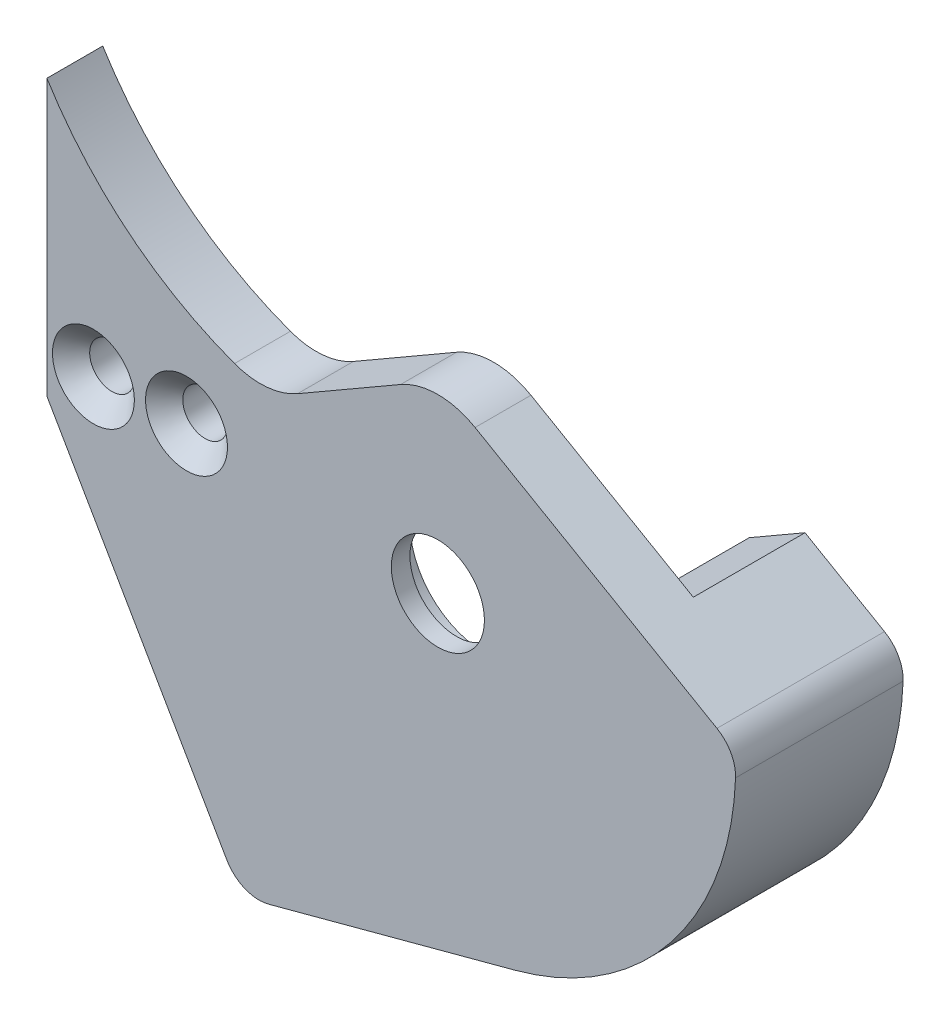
ISO-10303-21;
HEADER;
FILE_DESCRIPTION(('STEP AP214'),'2;1');
FILE_NAME('part.step','',(''),(''),'','','');
FILE_SCHEMA(('AUTOMOTIVE_DESIGN { 1 0 10303 214 1 1 1 1 }'));
ENDSEC;
DATA;
#1=APPLICATION_CONTEXT('core data for automotive mechanical design processes');
#2=APPLICATION_PROTOCOL_DEFINITION('international standard','automotive_design',2000,#1);
#3=PRODUCT_CONTEXT('',#1,'mechanical');
#4=PRODUCT('Part','Part','',(#3));
#5=PRODUCT_RELATED_PRODUCT_CATEGORY('part','',(#4));
#6=PRODUCT_DEFINITION_FORMATION('','',#4);
#7=PRODUCT_DEFINITION_CONTEXT('part definition',#1,'design');
#8=PRODUCT_DEFINITION('design','',#6,#7);
#9=PRODUCT_DEFINITION_SHAPE('','',#8);
#10=(LENGTH_UNIT() NAMED_UNIT(*) SI_UNIT(.MILLI.,.METRE.));
#11=(NAMED_UNIT(*) PLANE_ANGLE_UNIT() SI_UNIT($,.RADIAN.));
#12=(NAMED_UNIT(*) SI_UNIT($,.STERADIAN.) SOLID_ANGLE_UNIT());
#13=UNCERTAINTY_MEASURE_WITH_UNIT(LENGTH_MEASURE(1.E-05),#10,'distance_accuracy_value','');
#14=(GEOMETRIC_REPRESENTATION_CONTEXT(3) GLOBAL_UNCERTAINTY_ASSIGNED_CONTEXT((#13)) GLOBAL_UNIT_ASSIGNED_CONTEXT((#10,
#11,#12)) REPRESENTATION_CONTEXT('',''));
#15=CARTESIAN_POINT('',(0.,0.,0.));
#16=DIRECTION('',(0.,0.,1.));
#17=DIRECTION('',(1.,0.,0.));
#18=AXIS2_PLACEMENT_3D('',#15,#16,#17);
#19=CARTESIAN_POINT('',(39.,43.5,8.));
#20=DIRECTION('',(0.,0.,-1.));
#21=DIRECTION('',(-1.,0.,0.));
#22=AXIS2_PLACEMENT_3D('',#19,#20,#21);
#23=CYLINDRICAL_SURFACE('',#22,4.);
#24=CARTESIAN_POINT('',(39.,43.5,8.));
#25=DIRECTION('',(0.,0.,-1.));
#26=DIRECTION('',(-1.,0.,0.));
#27=AXIS2_PLACEMENT_3D('',#24,#25,#26);
#28=CIRCLE('',#27,4.);
#29=CARTESIAN_POINT('',(35.,43.5,8.));
#30=VERTEX_POINT('',#29);
#31=EDGE_CURVE('E305',#30,#30,#28,.T.);
#32=ORIENTED_EDGE('',*,*,#31,.F.);
#33=EDGE_LOOP('',(#32));
#34=FACE_BOUND('',#33,.T.);
#35=CARTESIAN_POINT('',(39.,43.5,6.5));
#36=DIRECTION('',(0.,0.,-1.));
#37=DIRECTION('',(-1.,0.,0.));
#38=AXIS2_PLACEMENT_3D('',#35,#36,#37);
#39=CIRCLE('',#38,4.);
#40=CARTESIAN_POINT('',(35.,43.5,6.5));
#41=VERTEX_POINT('',#40);
#42=EDGE_CURVE('E37',#41,#41,#39,.F.);
#43=ORIENTED_EDGE('',*,*,#42,.F.);
#44=EDGE_LOOP('',(#43));
#45=FACE_BOUND('',#44,.T.);
#46=ADVANCED_FACE('F33',(#34,#45),#23,.F.);
#47=CARTESIAN_POINT('',(39.,43.5,9.));
#48=DIRECTION('',(0.,0.,-1.));
#49=DIRECTION('',(-1.,0.,0.));
#50=AXIS2_PLACEMENT_3D('',#47,#48,#49);
#51=CYLINDRICAL_SURFACE('',#50,2.5);
#52=CARTESIAN_POINT('',(39.,43.5,9.));
#53=DIRECTION('',(0.,0.,1.));
#54=DIRECTION('',(1.,0.,0.));
#55=AXIS2_PLACEMENT_3D('',#52,#53,#54);
#56=CIRCLE('',#55,2.5);
#57=CARTESIAN_POINT('',(41.5,43.5,9.));
#58=VERTEX_POINT('',#57);
#59=EDGE_CURVE('E330',#58,#58,#56,.T.);
#60=ORIENTED_EDGE('',*,*,#59,.T.);
#61=EDGE_LOOP('',(#60));
#62=FACE_BOUND('',#61,.T.);
#63=CARTESIAN_POINT('',(39.,43.5,8.));
#64=DIRECTION('',(0.,0.,-1.));
#65=DIRECTION('',(-1.,0.,0.));
#66=AXIS2_PLACEMENT_3D('',#63,#64,#65);
#67=CIRCLE('',#66,2.5);
#68=CARTESIAN_POINT('',(36.5,43.5,8.));
#69=VERTEX_POINT('',#68);
#70=EDGE_CURVE('E202',#69,#69,#67,.T.);
#71=ORIENTED_EDGE('',*,*,#70,.T.);
#72=EDGE_LOOP('',(#71));
#73=FACE_BOUND('',#72,.T.);
#74=ADVANCED_FACE('F462',(#62,#73),#51,.F.);
#75=CARTESIAN_POINT('',(30.8459427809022,29.9270889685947,0.));
#76=DIRECTION('',(0.,0.,-1.));
#77=DIRECTION('',(-1.,0.,0.));
#78=AXIS2_PLACEMENT_3D('',#75,#76,#77);
#79=PLANE('',#78);
#80=DIRECTION('',(-0.866025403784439,-0.5,0.));
#81=VECTOR('',#80,1.);
#82=CARTESIAN_POINT('',(26.2161102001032,33.9461942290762,0.));
#83=LINE('',#82,#81);
#84=CARTESIAN_POINT('',(26.2161102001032,33.9461942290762,0.));
#85=VERTEX_POINT('',#84);
#86=CARTESIAN_POINT('',(23.6180339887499,32.4461942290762,0.));
#87=VERTEX_POINT('',#86);
#88=EDGE_CURVE('E181',#85,#87,#83,.T.);
#89=ORIENTED_EDGE('',*,*,#88,.F.);
#90=DIRECTION('',(-0.5,0.866025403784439,0.));
#91=VECTOR('',#90,1.);
#92=CARTESIAN_POINT('',(21.3425161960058,42.3875066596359,0.));
#93=LINE('',#92,#91);
#94=CARTESIAN_POINT('',(29.1138919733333,28.9270889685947,0.));
#95=VERTEX_POINT('',#94);
#96=EDGE_CURVE('E237',#95,#85,#93,.T.);
#97=ORIENTED_EDGE('',*,*,#96,.F.);
#98=CARTESIAN_POINT('',(30.8459427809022,29.9270889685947,0.));
#99=DIRECTION('',(0.,0.,-1.));
#100=DIRECTION('',(-1.,0.,0.));
#101=AXIS2_PLACEMENT_3D('',#98,#99,#100);
#102=CIRCLE('',#101,2.);
#103=CARTESIAN_POINT('',(31.3635808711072,27.9952373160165,0.));
#104=VERTEX_POINT('',#103);
#105=EDGE_CURVE('E234',#104,#95,#102,.T.);
#106=ORIENTED_EDGE('',*,*,#105,.F.);
#107=DIRECTION('',(-0.965925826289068,-0.258819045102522,0.));
#108=VECTOR('',#107,1.);
#109=CARTESIAN_POINT('',(31.3635808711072,27.9952373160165,0.));
#110=LINE('',#109,#108);
#111=CARTESIAN_POINT('',(42.3646475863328,30.9429642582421,0.));
#112=VERTEX_POINT('',#111);
#113=EDGE_CURVE('E232',#112,#104,#110,.T.);
#114=ORIENTED_EDGE('',*,*,#113,.F.);
#115=CARTESIAN_POINT('',(39.,43.5,0.));
#116=DIRECTION('',(0.,0.,-1.));
#117=DIRECTION('',(1.,0.,0.));
#118=AXIS2_PLACEMENT_3D('',#115,#116,#117);
#119=CIRCLE('',#118,13.);
#120=CARTESIAN_POINT('',(51.7540554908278,40.9832424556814,0.));
#121=VERTEX_POINT('',#120);
#122=EDGE_CURVE('E230',#121,#112,#119,.T.);
#123=ORIENTED_EDGE('',*,*,#122,.F.);
#124=CARTESIAN_POINT('',(49.7918931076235,41.3704359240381,0.));
#125=DIRECTION('',(0.,0.,-1.));
#126=DIRECTION('',(-1.,0.,0.));
#127=AXIS2_PLACEMENT_3D('',#124,#125,#126);
#128=CIRCLE('',#127,2.);
#129=CARTESIAN_POINT('',(50.7918931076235,43.102486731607,0.));
#130=VERTEX_POINT('',#129);
#131=EDGE_CURVE('E228',#130,#121,#128,.T.);
#132=ORIENTED_EDGE('',*,*,#131,.F.);
#133=DIRECTION('',(0.866025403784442,-0.499999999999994,0.));
#134=VECTOR('',#133,1.);
#135=CARTESIAN_POINT('',(46.7204784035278,45.4531191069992,0.));
#136=LINE('',#135,#134);
#137=CARTESIAN_POINT('',(46.7204784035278,45.4531191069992,0.));
#138=VERTEX_POINT('',#137);
#139=EDGE_CURVE('E226',#138,#130,#136,.T.);
#140=ORIENTED_EDGE('',*,*,#139,.F.);
#141=DIRECTION('',(-0.866025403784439,-0.5,0.));
#142=VECTOR('',#141,1.);
#143=CARTESIAN_POINT('',(46.7204784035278,45.4531191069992,0.));
#144=LINE('',#143,#142);
#145=CARTESIAN_POINT('',(49.7204784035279,47.1851699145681,0.));
#146=VERTEX_POINT('',#145);
#147=EDGE_CURVE('E224',#146,#138,#144,.T.);
#148=ORIENTED_EDGE('',*,*,#147,.F.);
#149=DIRECTION('',(-0.866025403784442,0.499999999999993,0.));
#150=VECTOR('',#149,1.);
#151=CARTESIAN_POINT('',(49.7204784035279,47.1851699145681,0.));
#152=LINE('',#151,#150);
#153=CARTESIAN_POINT('',(53.9906253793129,44.7197994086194,0.));
#154=VERTEX_POINT('',#153);
#155=EDGE_CURVE('E222',#154,#146,#152,.T.);
#156=ORIENTED_EDGE('',*,*,#155,.F.);
#157=CARTESIAN_POINT('',(52.9906253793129,42.9877486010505,0.));
#158=DIRECTION('',(0.,0.,1.));
#159=DIRECTION('',(-1.,0.,0.));
#160=AXIS2_PLACEMENT_3D('',#157,#158,#159);
#161=CIRCLE('',#160,2.);
#162=CARTESIAN_POINT('',(54.9892861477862,42.914569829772,0.));
#163=VERTEX_POINT('',#162);
#164=EDGE_CURVE('E220',#163,#154,#161,.T.);
#165=ORIENTED_EDGE('',*,*,#164,.F.);
#166=CARTESIAN_POINT('',(39.,43.5,0.));
#167=DIRECTION('',(0.,0.,1.));
#168=DIRECTION('',(1.,0.,0.));
#169=AXIS2_PLACEMENT_3D('',#166,#167,#168);
#170=CIRCLE('',#169,16.);
#171=CARTESIAN_POINT('',(43.1411047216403,28.0451867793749,0.));
#172=VERTEX_POINT('',#171);
#173=EDGE_CURVE('E218',#172,#163,#170,.T.);
#174=ORIENTED_EDGE('',*,*,#173,.F.);
#175=DIRECTION('',(0.965925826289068,0.258819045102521,0.));
#176=VECTOR('',#175,1.);
#177=CARTESIAN_POINT('',(29.9164951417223,24.501663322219,0.));
#178=LINE('',#177,#176);
#179=CARTESIAN_POINT('',(29.9164951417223,24.501663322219,0.));
#180=VERTEX_POINT('',#179);
#181=EDGE_CURVE('E216',#180,#172,#178,.T.);
#182=ORIENTED_EDGE('',*,*,#181,.F.);
#183=CARTESIAN_POINT('',(29.3988570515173,26.4335149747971,0.));
#184=DIRECTION('',(0.,0.,1.));
#185=DIRECTION('',(-1.,0.,0.));
#186=AXIS2_PLACEMENT_3D('',#183,#184,#185);
#187=CIRCLE('',#186,2.);
#188=CARTESIAN_POINT('',(27.6668062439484,25.4335149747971,0.));
#189=VERTEX_POINT('',#188);
#190=EDGE_CURVE('E207',#189,#180,#187,.T.);
#191=ORIENTED_EDGE('',*,*,#190,.F.);
#192=DIRECTION('',(0.5,-0.866025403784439,0.));
#193=VECTOR('',#192,1.);
#194=CARTESIAN_POINT('',(18.,42.1769145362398,0.));
#195=LINE('',#194,#193);
#196=EDGE_CURVE('E198',#87,#189,#195,.T.);
#197=ORIENTED_EDGE('',*,*,#196,.F.);
#198=EDGE_LOOP('',(#89,#97,#106,#114,#123,#132,#140,#148,#156,#165,#174,#182,#191,#197));
#199=FACE_BOUND('',#198,.T.);
#200=ADVANCED_FACE('F205',(#199),#79,.T.);
#201=CARTESIAN_POINT('',(18.,42.1769145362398,6.));
#202=DIRECTION('',(0.062879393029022,-0.998021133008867,0.));
#203=DIRECTION('',(0.998021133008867,0.062879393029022,0.));
#204=AXIS2_PLACEMENT_3D('',#201,#202,#203);
#205=PLANE('',#204);
#206=DIRECTION('',(-0.998021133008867,-0.062879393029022,0.));
#207=VECTOR('',#206,1.);
#208=CARTESIAN_POINT('',(18.,42.1769145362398,0.));
#209=LINE('',#208,#207);
#210=CARTESIAN_POINT('',(21.3425161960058,42.3875066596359,0.));
#211=VERTEX_POINT('',#210);
#212=CARTESIAN_POINT('',(18.,42.1769145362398,0.));
#213=VERTEX_POINT('',#212);
#214=EDGE_CURVE('E208',#211,#213,#209,.T.);
#215=ORIENTED_EDGE('',*,*,#214,.T.);
#216=DIRECTION('',(0.,0.,-1.));
#217=VECTOR('',#216,1.);
#218=CARTESIAN_POINT('',(18.,42.1769145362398,6.));
#219=LINE('',#218,#217);
#220=CARTESIAN_POINT('',(18.,42.1769145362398,6.));
#221=VERTEX_POINT('',#220);
#222=EDGE_CURVE('E277',#221,#213,#219,.T.);
#223=ORIENTED_EDGE('',*,*,#222,.F.);
#224=DIRECTION('',(-0.998021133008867,-0.062879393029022,0.));
#225=VECTOR('',#224,1.);
#226=CARTESIAN_POINT('',(18.,42.1769145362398,6.));
#227=LINE('',#226,#225);
#228=CARTESIAN_POINT('',(21.3425161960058,42.3875066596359,6.));
#229=VERTEX_POINT('',#228);
#230=EDGE_CURVE('E239',#229,#221,#227,.T.);
#231=ORIENTED_EDGE('',*,*,#230,.F.);
#232=DIRECTION('',(0.,0.,-1.));
#233=VECTOR('',#232,1.);
#234=CARTESIAN_POINT('',(21.3425161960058,42.3875066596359,6.));
#235=LINE('',#234,#233);
#236=EDGE_CURVE('E240',#229,#211,#235,.T.);
#237=ORIENTED_EDGE('',*,*,#236,.T.);
#238=EDGE_LOOP('',(#215,#223,#231,#237));
#239=FACE_BOUND('',#238,.T.);
#240=ADVANCED_FACE('F401',(#239),#205,.F.);
#241=CARTESIAN_POINT('',(18.,42.1769145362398,6.));
#242=DIRECTION('',(0.866025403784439,0.5,0.));
#243=DIRECTION('',(-0.5,0.866025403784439,0.));
#244=AXIS2_PLACEMENT_3D('',#241,#242,#243);
#245=PLANE('',#244);
#246=CARTESIAN_POINT('',(21.3819660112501,36.3191775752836,0.));
#247=VERTEX_POINT('',#246);
#248=EDGE_CURVE('E201',#213,#247,#195,.T.);
#249=ORIENTED_EDGE('',*,*,#248,.T.);
#250=CARTESIAN_POINT('',(22.5,34.3826859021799,2.));
#251=DIRECTION('',(-0.866025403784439,-0.5,0.));
#252=DIRECTION('',(0.5,-0.866025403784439,0.));
#253=AXIS2_PLACEMENT_3D('',#250,#251,#252);
#254=CIRCLE('',#253,3.);
#255=EDGE_CURVE('E184',#87,#247,#254,.T.);
#256=ORIENTED_EDGE('',*,*,#255,.F.);
#257=ORIENTED_EDGE('',*,*,#196,.T.);
#258=DIRECTION('',(0.,0.,-1.));
#259=VECTOR('',#258,1.);
#260=CARTESIAN_POINT('',(27.6668062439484,25.4335149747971,6.));
#261=LINE('',#260,#259);
#262=CARTESIAN_POINT('',(27.6668062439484,25.4335149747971,9.));
#263=VERTEX_POINT('',#262);
#264=EDGE_CURVE('E275',#263,#189,#261,.T.);
#265=ORIENTED_EDGE('',*,*,#264,.F.);
#266=DIRECTION('',(0.5,-0.866025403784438,0.));
#267=VECTOR('',#266,1.);
#268=CARTESIAN_POINT('',(18.,42.1769145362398,9.));
#269=LINE('',#268,#267);
#270=CARTESIAN_POINT('',(18.,42.1769145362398,9.));
#271=VERTEX_POINT('',#270);
#272=EDGE_CURVE('E338',#271,#263,#269,.T.);
#273=ORIENTED_EDGE('',*,*,#272,.F.);
#274=DIRECTION('',(0.,0.,-1.));
#275=VECTOR('',#274,1.);
#276=CARTESIAN_POINT('',(18.,42.1769145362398,9.));
#277=LINE('',#276,#275);
#278=EDGE_CURVE('E211',#271,#221,#277,.T.);
#279=ORIENTED_EDGE('',*,*,#278,.T.);
#280=ORIENTED_EDGE('',*,*,#222,.T.);
#281=EDGE_LOOP('',(#249,#256,#257,#265,#273,#279,#280));
#282=FACE_BOUND('',#281,.T.);
#283=ADVANCED_FACE('F197',(#282),#245,.F.);
#284=CARTESIAN_POINT('',(29.3988570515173,26.4335149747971,6.));
#285=DIRECTION('',(0.,0.,-1.));
#286=DIRECTION('',(-1.,0.,0.));
#287=AXIS2_PLACEMENT_3D('',#284,#285,#286);
#288=CYLINDRICAL_SURFACE('',#287,2.);
#289=ORIENTED_EDGE('',*,*,#190,.T.);
#290=DIRECTION('',(0.,0.,-1.));
#291=VECTOR('',#290,1.);
#292=CARTESIAN_POINT('',(29.9164951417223,24.501663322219,6.));
#293=LINE('',#292,#291);
#294=CARTESIAN_POINT('',(29.9164951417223,24.501663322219,9.));
#295=VERTEX_POINT('',#294);
#296=EDGE_CURVE('E272',#295,#180,#293,.T.);
#297=ORIENTED_EDGE('',*,*,#296,.F.);
#298=CARTESIAN_POINT('',(29.3988570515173,26.4335149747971,9.));
#299=DIRECTION('',(0.,0.,1.));
#300=DIRECTION('',(-1.,0.,0.));
#301=AXIS2_PLACEMENT_3D('',#298,#299,#300);
#302=CIRCLE('',#301,2.);
#303=EDGE_CURVE('E342',#263,#295,#302,.T.);
#304=ORIENTED_EDGE('',*,*,#303,.F.);
#305=ORIENTED_EDGE('',*,*,#264,.T.);
#306=EDGE_LOOP('',(#289,#297,#304,#305));
#307=FACE_BOUND('',#306,.T.);
#308=ADVANCED_FACE('F426',(#307),#288,.T.);
#309=CARTESIAN_POINT('',(29.9164951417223,24.501663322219,6.));
#310=DIRECTION('',(-0.258819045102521,0.965925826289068,0.));
#311=DIRECTION('',(-0.965925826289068,-0.258819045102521,0.));
#312=AXIS2_PLACEMENT_3D('',#309,#310,#311);
#313=PLANE('',#312);
#314=ORIENTED_EDGE('',*,*,#181,.T.);
#315=DIRECTION('',(0.,0.,-1.));
#316=VECTOR('',#315,1.);
#317=CARTESIAN_POINT('',(43.1411047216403,28.0451867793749,6.));
#318=LINE('',#317,#316);
#319=CARTESIAN_POINT('',(43.1411047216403,28.0451867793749,9.));
#320=VERTEX_POINT('',#319);
#321=EDGE_CURVE('E269',#320,#172,#318,.T.);
#322=ORIENTED_EDGE('',*,*,#321,.F.);
#323=DIRECTION('',(0.965925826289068,0.258819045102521,0.));
#324=VECTOR('',#323,1.);
#325=CARTESIAN_POINT('',(29.9164951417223,24.501663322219,9.));
#326=LINE('',#325,#324);
#327=EDGE_CURVE('E345',#295,#320,#326,.T.);
#328=ORIENTED_EDGE('',*,*,#327,.F.);
#329=ORIENTED_EDGE('',*,*,#296,.T.);
#330=EDGE_LOOP('',(#314,#322,#328,#329));
#331=FACE_BOUND('',#330,.T.);
#332=ADVANCED_FACE('F428',(#331),#313,.F.);
#333=CARTESIAN_POINT('',(39.,43.5,6.));
#334=DIRECTION('',(0.,0.,-1.));
#335=DIRECTION('',(-1.,0.,0.));
#336=AXIS2_PLACEMENT_3D('',#333,#334,#335);
#337=CYLINDRICAL_SURFACE('',#336,16.);
#338=ORIENTED_EDGE('',*,*,#173,.T.);
#339=DIRECTION('',(0.,0.,-1.));
#340=VECTOR('',#339,1.);
#341=CARTESIAN_POINT('',(54.9892861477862,42.914569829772,6.));
#342=LINE('',#341,#340);
#343=CARTESIAN_POINT('',(54.9892861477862,42.914569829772,9.));
#344=VERTEX_POINT('',#343);
#345=EDGE_CURVE('E266',#344,#163,#342,.T.);
#346=ORIENTED_EDGE('',*,*,#345,.F.);
#347=CARTESIAN_POINT('',(39.,43.5,9.));
#348=DIRECTION('',(0.,0.,1.));
#349=DIRECTION('',(1.,0.,0.));
#350=AXIS2_PLACEMENT_3D('',#347,#348,#349);
#351=CIRCLE('',#350,16.);
#352=EDGE_CURVE('E348',#320,#344,#351,.T.);
#353=ORIENTED_EDGE('',*,*,#352,.F.);
#354=ORIENTED_EDGE('',*,*,#321,.T.);
#355=EDGE_LOOP('',(#338,#346,#353,#354));
#356=FACE_BOUND('',#355,.T.);
#357=ADVANCED_FACE('F433',(#356),#337,.T.);
#358=CARTESIAN_POINT('',(52.9906253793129,42.9877486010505,6.));
#359=DIRECTION('',(0.,0.,-1.));
#360=DIRECTION('',(-1.,0.,0.));
#361=AXIS2_PLACEMENT_3D('',#358,#359,#360);
#362=CYLINDRICAL_SURFACE('',#361,2.);
#363=ORIENTED_EDGE('',*,*,#164,.T.);
#364=DIRECTION('',(0.,0.,-1.));
#365=VECTOR('',#364,1.);
#366=CARTESIAN_POINT('',(53.9906253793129,44.7197994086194,6.));
#367=LINE('',#366,#365);
#368=CARTESIAN_POINT('',(53.9906253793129,44.7197994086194,9.));
#369=VERTEX_POINT('',#368);
#370=EDGE_CURVE('E263',#369,#154,#367,.T.);
#371=ORIENTED_EDGE('',*,*,#370,.F.);
#372=CARTESIAN_POINT('',(52.9906253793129,42.9877486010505,9.));
#373=DIRECTION('',(0.,0.,1.));
#374=DIRECTION('',(-1.,0.,0.));
#375=AXIS2_PLACEMENT_3D('',#372,#373,#374);
#376=CIRCLE('',#375,2.);
#377=EDGE_CURVE('E351',#344,#369,#376,.T.);
#378=ORIENTED_EDGE('',*,*,#377,.F.);
#379=ORIENTED_EDGE('',*,*,#345,.T.);
#380=EDGE_LOOP('',(#363,#371,#378,#379));
#381=FACE_BOUND('',#380,.T.);
#382=ADVANCED_FACE('F437',(#381),#362,.T.);
#383=CARTESIAN_POINT('',(49.7204784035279,47.1851699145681,6.));
#384=DIRECTION('',(-0.499999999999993,-0.866025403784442,0.));
#385=DIRECTION('',(0.866025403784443,-0.499999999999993,0.));
#386=AXIS2_PLACEMENT_3D('',#383,#384,#385);
#387=PLANE('',#386);
#388=DIRECTION('',(-0.866025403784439,0.5,0.));
#389=VECTOR('',#388,1.);
#390=CARTESIAN_POINT('',(39.,53.3746410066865,6.));
#391=LINE('',#390,#389);
#392=CARTESIAN_POINT('',(49.7204784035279,47.1851699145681,6.));
#393=VERTEX_POINT('',#392);
#394=CARTESIAN_POINT('',(40.9999999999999,52.2199404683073,6.));
#395=VERTEX_POINT('',#394);
#396=EDGE_CURVE('E363',#393,#395,#391,.T.);
#397=ORIENTED_EDGE('',*,*,#396,.T.);
#398=DIRECTION('',(0.,0.,-1.));
#399=VECTOR('',#398,1.);
#400=CARTESIAN_POINT('',(40.9999999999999,52.2199404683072,6.));
#401=LINE('',#400,#399);
#402=CARTESIAN_POINT('',(40.9999999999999,52.2199404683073,9.));
#403=VERTEX_POINT('',#402);
#404=EDGE_CURVE('E56',#395,#403,#401,.F.);
#405=ORIENTED_EDGE('',*,*,#404,.T.);
#406=DIRECTION('',(-0.866025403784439,0.5,0.));
#407=VECTOR('',#406,1.);
#408=CARTESIAN_POINT('',(39.,53.3746410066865,9.));
#409=LINE('',#408,#407);
#410=EDGE_CURVE('E354',#369,#403,#409,.T.);
#411=ORIENTED_EDGE('',*,*,#410,.F.);
#412=ORIENTED_EDGE('',*,*,#370,.T.);
#413=ORIENTED_EDGE('',*,*,#155,.T.);
#414=DIRECTION('',(0.,0.,-1.));
#415=VECTOR('',#414,1.);
#416=CARTESIAN_POINT('',(49.7204784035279,47.1851699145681,6.));
#417=LINE('',#416,#415);
#418=EDGE_CURVE('E262',#393,#146,#417,.T.);
#419=ORIENTED_EDGE('',*,*,#418,.F.);
#420=EDGE_LOOP('',(#397,#405,#411,#412,#413,#419));
#421=FACE_BOUND('',#420,.T.);
#422=ADVANCED_FACE('F439',(#421),#387,.F.);
#423=CARTESIAN_POINT('',(46.7204784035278,45.4531191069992,6.));
#424=DIRECTION('',(0.5,-0.866025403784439,0.));
#425=DIRECTION('',(0.866025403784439,0.5,0.));
#426=AXIS2_PLACEMENT_3D('',#423,#424,#425);
#427=PLANE('',#426);
#428=ORIENTED_EDGE('',*,*,#147,.T.);
#429=DIRECTION('',(0.,0.,-1.));
#430=VECTOR('',#429,1.);
#431=CARTESIAN_POINT('',(46.7204784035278,45.4531191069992,6.));
#432=LINE('',#431,#430);
#433=CARTESIAN_POINT('',(46.7204784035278,45.4531191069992,6.));
#434=VERTEX_POINT('',#433);
#435=EDGE_CURVE('E259',#434,#138,#432,.T.);
#436=ORIENTED_EDGE('',*,*,#435,.F.);
#437=DIRECTION('',(-0.866025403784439,-0.5,0.));
#438=VECTOR('',#437,1.);
#439=CARTESIAN_POINT('',(46.7204784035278,45.4531191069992,6.));
#440=LINE('',#439,#438);
#441=EDGE_CURVE('E283',#393,#434,#440,.T.);
#442=ORIENTED_EDGE('',*,*,#441,.F.);
#443=ORIENTED_EDGE('',*,*,#418,.T.);
#444=EDGE_LOOP('',(#428,#436,#442,#443));
#445=FACE_BOUND('',#444,.T.);
#446=ADVANCED_FACE('F444',(#445),#427,.F.);
#447=CARTESIAN_POINT('',(46.7204784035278,45.4531191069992,6.));
#448=DIRECTION('',(0.499999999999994,0.866025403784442,0.));
#449=DIRECTION('',(-0.866025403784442,0.499999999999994,0.));
#450=AXIS2_PLACEMENT_3D('',#447,#448,#449);
#451=PLANE('',#450);
#452=ORIENTED_EDGE('',*,*,#139,.T.);
#453=DIRECTION('',(0.,0.,-1.));
#454=VECTOR('',#453,1.);
#455=CARTESIAN_POINT('',(50.7918931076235,43.102486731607,6.));
#456=LINE('',#455,#454);
#457=CARTESIAN_POINT('',(50.7918931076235,43.102486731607,6.));
#458=VERTEX_POINT('',#457);
#459=EDGE_CURVE('E256',#458,#130,#456,.T.);
#460=ORIENTED_EDGE('',*,*,#459,.F.);
#461=DIRECTION('',(0.866025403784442,-0.499999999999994,0.));
#462=VECTOR('',#461,1.);
#463=CARTESIAN_POINT('',(46.7204784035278,45.4531191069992,6.));
#464=LINE('',#463,#462);
#465=EDGE_CURVE('E286',#434,#458,#464,.T.);
#466=ORIENTED_EDGE('',*,*,#465,.F.);
#467=ORIENTED_EDGE('',*,*,#435,.T.);
#468=EDGE_LOOP('',(#452,#460,#466,#467));
#469=FACE_BOUND('',#468,.T.);
#470=ADVANCED_FACE('F448',(#469),#451,.F.);
#471=CARTESIAN_POINT('',(49.7918931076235,41.3704359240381,6.));
#472=DIRECTION('',(0.,0.,-1.));
#473=DIRECTION('',(-1.,0.,0.));
#474=AXIS2_PLACEMENT_3D('',#471,#472,#473);
#475=CYLINDRICAL_SURFACE('',#474,2.);
#476=ORIENTED_EDGE('',*,*,#131,.T.);
#477=DIRECTION('',(0.,0.,-1.));
#478=VECTOR('',#477,1.);
#479=CARTESIAN_POINT('',(51.7540554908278,40.9832424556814,6.));
#480=LINE('',#479,#478);
#481=CARTESIAN_POINT('',(51.7540554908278,40.9832424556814,6.));
#482=VERTEX_POINT('',#481);
#483=EDGE_CURVE('E253',#482,#121,#480,.T.);
#484=ORIENTED_EDGE('',*,*,#483,.F.);
#485=CARTESIAN_POINT('',(49.7918931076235,41.3704359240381,6.));
#486=DIRECTION('',(0.,0.,-1.));
#487=DIRECTION('',(-1.,0.,0.));
#488=AXIS2_PLACEMENT_3D('',#485,#486,#487);
#489=CIRCLE('',#488,2.);
#490=EDGE_CURVE('E376',#458,#482,#489,.T.);
#491=ORIENTED_EDGE('',*,*,#490,.F.);
#492=ORIENTED_EDGE('',*,*,#459,.T.);
#493=EDGE_LOOP('',(#476,#484,#491,#492));
#494=FACE_BOUND('',#493,.T.);
#495=ADVANCED_FACE('F502',(#494),#475,.F.);
#496=CARTESIAN_POINT('',(39.,43.5,6.));
#497=DIRECTION('',(0.,0.,-1.));
#498=DIRECTION('',(-1.,0.,0.));
#499=AXIS2_PLACEMENT_3D('',#496,#497,#498);
#500=CYLINDRICAL_SURFACE('',#499,13.);
#501=ORIENTED_EDGE('',*,*,#122,.T.);
#502=DIRECTION('',(0.,0.,-1.));
#503=VECTOR('',#502,1.);
#504=CARTESIAN_POINT('',(42.3646475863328,30.9429642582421,6.));
#505=LINE('',#504,#503);
#506=CARTESIAN_POINT('',(42.3646475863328,30.9429642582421,6.));
#507=VERTEX_POINT('',#506);
#508=EDGE_CURVE('E250',#507,#112,#505,.T.);
#509=ORIENTED_EDGE('',*,*,#508,.F.);
#510=CARTESIAN_POINT('',(39.,43.5,6.));
#511=DIRECTION('',(0.,0.,-1.));
#512=DIRECTION('',(1.,0.,0.));
#513=AXIS2_PLACEMENT_3D('',#510,#511,#512);
#514=CIRCLE('',#513,13.);
#515=EDGE_CURVE('E379',#482,#507,#514,.T.);
#516=ORIENTED_EDGE('',*,*,#515,.F.);
#517=ORIENTED_EDGE('',*,*,#483,.T.);
#518=EDGE_LOOP('',(#501,#509,#516,#517));
#519=FACE_BOUND('',#518,.T.);
#520=ADVANCED_FACE('F498',(#519),#500,.F.);
#521=CARTESIAN_POINT('',(31.3635808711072,27.9952373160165,6.));
#522=DIRECTION('',(0.258819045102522,-0.965925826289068,0.));
#523=DIRECTION('',(0.965925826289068,0.258819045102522,0.));
#524=AXIS2_PLACEMENT_3D('',#521,#522,#523);
#525=PLANE('',#524);
#526=ORIENTED_EDGE('',*,*,#113,.T.);
#527=DIRECTION('',(0.,0.,-1.));
#528=VECTOR('',#527,1.);
#529=CARTESIAN_POINT('',(31.3635808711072,27.9952373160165,6.));
#530=LINE('',#529,#528);
#531=CARTESIAN_POINT('',(31.3635808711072,27.9952373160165,6.));
#532=VERTEX_POINT('',#531);
#533=EDGE_CURVE('E247',#532,#104,#530,.T.);
#534=ORIENTED_EDGE('',*,*,#533,.F.);
#535=DIRECTION('',(-0.965925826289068,-0.258819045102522,0.));
#536=VECTOR('',#535,1.);
#537=CARTESIAN_POINT('',(31.3635808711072,27.9952373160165,6.));
#538=LINE('',#537,#536);
#539=EDGE_CURVE('E382',#507,#532,#538,.T.);
#540=ORIENTED_EDGE('',*,*,#539,.F.);
#541=ORIENTED_EDGE('',*,*,#508,.T.);
#542=EDGE_LOOP('',(#526,#534,#540,#541));
#543=FACE_BOUND('',#542,.T.);
#544=ADVANCED_FACE('F494',(#543),#525,.F.);
#545=CARTESIAN_POINT('',(30.8459427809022,29.9270889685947,6.));
#546=DIRECTION('',(0.,0.,-1.));
#547=DIRECTION('',(-1.,0.,0.));
#548=AXIS2_PLACEMENT_3D('',#545,#546,#547);
#549=CYLINDRICAL_SURFACE('',#548,2.);
#550=ORIENTED_EDGE('',*,*,#105,.T.);
#551=DIRECTION('',(0.,0.,-1.));
#552=VECTOR('',#551,1.);
#553=CARTESIAN_POINT('',(29.1138919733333,28.9270889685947,6.));
#554=LINE('',#553,#552);
#555=CARTESIAN_POINT('',(29.1138919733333,28.9270889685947,6.));
#556=VERTEX_POINT('',#555);
#557=EDGE_CURVE('E243',#556,#95,#554,.T.);
#558=ORIENTED_EDGE('',*,*,#557,.F.);
#559=CARTESIAN_POINT('',(30.8459427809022,29.9270889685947,6.));
#560=DIRECTION('',(0.,0.,-1.));
#561=DIRECTION('',(-1.,0.,0.));
#562=AXIS2_PLACEMENT_3D('',#559,#560,#561);
#563=CIRCLE('',#562,2.);
#564=EDGE_CURVE('E385',#532,#556,#563,.T.);
#565=ORIENTED_EDGE('',*,*,#564,.F.);
#566=ORIENTED_EDGE('',*,*,#533,.T.);
#567=EDGE_LOOP('',(#550,#558,#565,#566));
#568=FACE_BOUND('',#567,.T.);
#569=ADVANCED_FACE('F491',(#568),#549,.F.);
#570=CARTESIAN_POINT('',(21.3425161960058,42.3875066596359,6.));
#571=DIRECTION('',(-0.866025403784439,-0.5,0.));
#572=DIRECTION('',(0.5,-0.866025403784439,0.));
#573=AXIS2_PLACEMENT_3D('',#570,#571,#572);
#574=PLANE('',#573);
#575=ORIENTED_EDGE('',*,*,#96,.T.);
#576=CARTESIAN_POINT('',(25.0980762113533,35.8826859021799,2.));
#577=DIRECTION('',(-0.866025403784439,-0.5,0.));
#578=DIRECTION('',(0.5,-0.866025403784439,0.));
#579=AXIS2_PLACEMENT_3D('',#576,#577,#578);
#580=CIRCLE('',#579,3.);
#581=CARTESIAN_POINT('',(23.9800422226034,37.8191775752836,0.));
#582=VERTEX_POINT('',#581);
#583=EDGE_CURVE('E187',#85,#582,#580,.T.);
#584=ORIENTED_EDGE('',*,*,#583,.T.);
#585=EDGE_CURVE('E236',#582,#211,#93,.T.);
#586=ORIENTED_EDGE('',*,*,#585,.T.);
#587=ORIENTED_EDGE('',*,*,#236,.F.);
#588=DIRECTION('',(-0.5,0.866025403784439,0.));
#589=VECTOR('',#588,1.);
#590=CARTESIAN_POINT('',(21.3425161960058,42.3875066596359,6.));
#591=LINE('',#590,#589);
#592=EDGE_CURVE('E244',#556,#229,#591,.T.);
#593=ORIENTED_EDGE('',*,*,#592,.F.);
#594=ORIENTED_EDGE('',*,*,#557,.T.);
#595=EDGE_LOOP('',(#575,#584,#586,#587,#593,#594));
#596=FACE_BOUND('',#595,.T.);
#597=ADVANCED_FACE('F397',(#596),#574,.F.);
#598=DIRECTION('',(-0.866025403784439,-0.5,0.));
#599=VECTOR('',#598,1.);
#600=CARTESIAN_POINT('',(23.9800422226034,37.8191775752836,0.));
#601=LINE('',#600,#599);
#602=EDGE_CURVE('E193',#247,#582,#601,.F.);
#603=ORIENTED_EDGE('',*,*,#602,.F.);
#604=ORIENTED_EDGE('',*,*,#248,.F.);
#605=ORIENTED_EDGE('',*,*,#214,.F.);
#606=ORIENTED_EDGE('',*,*,#585,.F.);
#607=EDGE_LOOP('',(#603,#604,#605,#606));
#608=FACE_BOUND('',#607,.T.);
#609=ADVANCED_FACE('F403',(#608),#79,.T.);
#610=CARTESIAN_POINT('',(35.,67.5,6.));
#611=DIRECTION('',(0.,0.,1.));
#612=DIRECTION('',(1.,0.,0.));
#613=AXIS2_PLACEMENT_3D('',#610,#611,#612);
#614=PLANE('',#613);
#615=CARTESIAN_POINT('',(39.,43.5,6.));
#616=DIRECTION('',(0.,0.,-1.));
#617=DIRECTION('',(-1.,0.,0.));
#618=AXIS2_PLACEMENT_3D('',#615,#616,#617);
#619=CIRCLE('',#618,5.99999999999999);
#620=CARTESIAN_POINT('',(33.,43.5,6.));
#621=VERTEX_POINT('',#620);
#622=EDGE_CURVE('E631',#621,#621,#619,.T.);
#623=ORIENTED_EDGE('',*,*,#622,.F.);
#624=EDGE_LOOP('',(#623));
#625=FACE_BOUND('',#624,.T.);
#626=CARTESIAN_POINT('',(20.5,44.3383902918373,6.));
#627=DIRECTION('',(0.,0.,1.));
#628=DIRECTION('',(1.,0.,0.));
#629=AXIS2_PLACEMENT_3D('',#626,#627,#628);
#630=CIRCLE('',#629,1.2);
#631=CARTESIAN_POINT('',(21.7,44.3383902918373,6.));
#632=VERTEX_POINT('',#631);
#633=EDGE_CURVE('E309',#632,#632,#630,.T.);
#634=ORIENTED_EDGE('',*,*,#633,.T.);
#635=EDGE_LOOP('',(#634));
#636=FACE_BOUND('',#635,.T.);
#637=CARTESIAN_POINT('',(25.5,44.6534106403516,6.));
#638=DIRECTION('',(0.,0.,1.));
#639=DIRECTION('',(1.,0.,0.));
#640=AXIS2_PLACEMENT_3D('',#637,#638,#639);
#641=CIRCLE('',#640,1.2);
#642=CARTESIAN_POINT('',(26.7,44.6534106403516,6.));
#643=VERTEX_POINT('',#642);
#644=EDGE_CURVE('E306',#643,#643,#641,.T.);
#645=ORIENTED_EDGE('',*,*,#644,.T.);
#646=EDGE_LOOP('',(#645));
#647=FACE_BOUND('',#646,.T.);
#648=DIRECTION('',(-0.866025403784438,-0.500000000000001,0.));
#649=VECTOR('',#648,1.);
#650=CARTESIAN_POINT('',(39.,53.3746410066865,6.));
#651=LINE('',#650,#649);
#652=CARTESIAN_POINT('',(36.9999999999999,52.2199404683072,6.));
#653=VERTEX_POINT('',#652);
#654=CARTESIAN_POINT('',(31.4644405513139,49.0239837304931,6.));
#655=VERTEX_POINT('',#654);
#656=EDGE_CURVE('E366',#653,#655,#651,.T.);
#657=ORIENTED_EDGE('',*,*,#656,.F.);
#658=CARTESIAN_POINT('',(38.9999999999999,48.7558388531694,6.));
#659=DIRECTION('',(0.,0.,1.));
#660=DIRECTION('',(1.,0.,0.));
#661=AXIS2_PLACEMENT_3D('',#658,#659,#660);
#662=CIRCLE('',#661,4.);
#663=EDGE_CURVE('E294',#653,#395,#662,.F.);
#664=ORIENTED_EDGE('',*,*,#663,.T.);
#665=ORIENTED_EDGE('',*,*,#396,.F.);
#666=ORIENTED_EDGE('',*,*,#441,.T.);
#667=ORIENTED_EDGE('',*,*,#465,.T.);
#668=ORIENTED_EDGE('',*,*,#490,.T.);
#669=ORIENTED_EDGE('',*,*,#515,.T.);
#670=ORIENTED_EDGE('',*,*,#539,.T.);
#671=ORIENTED_EDGE('',*,*,#564,.T.);
#672=ORIENTED_EDGE('',*,*,#592,.T.);
#673=ORIENTED_EDGE('',*,*,#230,.T.);
#674=DIRECTION('',(0.,-1.,0.));
#675=VECTOR('',#674,1.);
#676=CARTESIAN_POINT('',(18.,42.1769145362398,6.));
#677=LINE('',#676,#675);
#678=CARTESIAN_POINT('',(18.,56.9643462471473,6.));
#679=VERTEX_POINT('',#678);
#680=EDGE_CURVE('E334',#679,#221,#677,.T.);
#681=ORIENTED_EDGE('',*,*,#680,.F.);
#682=CARTESIAN_POINT('',(35.,67.5,6.));
#683=DIRECTION('',(0.,0.,-1.));
#684=DIRECTION('',(1.,0.,0.));
#685=AXIS2_PLACEMENT_3D('',#682,#683,#684);
#686=CIRCLE('',#685,20.);
#687=CARTESIAN_POINT('',(28.0805506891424,48.7351066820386,6.));
#688=VERTEX_POINT('',#687);
#689=EDGE_CURVE('E339',#688,#679,#686,.T.);
#690=ORIENTED_EDGE('',*,*,#689,.F.);
#691=CARTESIAN_POINT('',(29.4644405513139,52.4880853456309,6.));
#692=DIRECTION('',(0.,0.,1.));
#693=DIRECTION('',(1.,0.,0.));
#694=AXIS2_PLACEMENT_3D('',#691,#692,#693);
#695=CIRCLE('',#694,4.);
#696=EDGE_CURVE('E42',#688,#655,#695,.T.);
#697=ORIENTED_EDGE('',*,*,#696,.T.);
#698=EDGE_LOOP('',(#657,#664,#665,#666,#667,#668,#669,#670,#671,#672,#673,#681,#690,#697));
#699=FACE_BOUND('',#698,.T.);
#700=ADVANCED_FACE('F391',(#625,#636,#647,#699),#614,.F.);
#701=CARTESIAN_POINT('',(35.,67.5,9.));
#702=DIRECTION('',(0.,0.,1.));
#703=DIRECTION('',(1.,0.,0.));
#704=AXIS2_PLACEMENT_3D('',#701,#702,#703);
#705=PLANE('',#704);
#706=CARTESIAN_POINT('',(20.5,44.3383902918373,9.));
#707=DIRECTION('',(0.,0.,1.));
#708=DIRECTION('',(1.,0.,0.));
#709=AXIS2_PLACEMENT_3D('',#706,#707,#708);
#710=CIRCLE('',#709,2.2);
#711=CARTESIAN_POINT('',(22.7,44.3383902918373,9.));
#712=VERTEX_POINT('',#711);
#713=EDGE_CURVE('E318',#712,#712,#710,.T.);
#714=ORIENTED_EDGE('',*,*,#713,.F.);
#715=EDGE_LOOP('',(#714));
#716=FACE_BOUND('',#715,.T.);
#717=CARTESIAN_POINT('',(25.5,44.6534106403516,9.));
#718=DIRECTION('',(0.,0.,1.));
#719=DIRECTION('',(1.,0.,0.));
#720=AXIS2_PLACEMENT_3D('',#717,#718,#719);
#721=CIRCLE('',#720,2.2);
#722=CARTESIAN_POINT('',(27.7,44.6534106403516,9.));
#723=VERTEX_POINT('',#722);
#724=EDGE_CURVE('E311',#723,#723,#721,.T.);
#725=ORIENTED_EDGE('',*,*,#724,.F.);
#726=EDGE_LOOP('',(#725));
#727=FACE_BOUND('',#726,.T.);
#728=ORIENTED_EDGE('',*,*,#410,.T.);
#729=CARTESIAN_POINT('',(38.9999999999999,48.7558388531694,9.));
#730=DIRECTION('',(0.,0.,1.));
#731=DIRECTION('',(1.,0.,0.));
#732=AXIS2_PLACEMENT_3D('',#729,#730,#731);
#733=CIRCLE('',#732,4.);
#734=CARTESIAN_POINT('',(36.9999999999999,52.2199404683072,9.));
#735=VERTEX_POINT('',#734);
#736=EDGE_CURVE('E297',#403,#735,#733,.T.);
#737=ORIENTED_EDGE('',*,*,#736,.T.);
#738=DIRECTION('',(-0.866025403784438,-0.500000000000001,0.));
#739=VECTOR('',#738,1.);
#740=CARTESIAN_POINT('',(39.,53.3746410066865,9.));
#741=LINE('',#740,#739);
#742=CARTESIAN_POINT('',(31.4644405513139,49.0239837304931,9.));
#743=VERTEX_POINT('',#742);
#744=EDGE_CURVE('E356',#735,#743,#741,.T.);
#745=ORIENTED_EDGE('',*,*,#744,.T.);
#746=CARTESIAN_POINT('',(29.4644405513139,52.4880853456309,9.));
#747=DIRECTION('',(0.,0.,1.));
#748=DIRECTION('',(1.,0.,0.));
#749=AXIS2_PLACEMENT_3D('',#746,#747,#748);
#750=CIRCLE('',#749,4.);
#751=CARTESIAN_POINT('',(28.0805506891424,48.7351066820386,9.));
#752=VERTEX_POINT('',#751);
#753=EDGE_CURVE('E11',#743,#752,#750,.F.);
#754=ORIENTED_EDGE('',*,*,#753,.T.);
#755=CARTESIAN_POINT('',(35.,67.5,9.));
#756=DIRECTION('',(0.,0.,-1.));
#757=DIRECTION('',(1.,0.,0.));
#758=AXIS2_PLACEMENT_3D('',#755,#756,#757);
#759=CIRCLE('',#758,20.);
#760=CARTESIAN_POINT('',(18.,56.9643462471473,9.));
#761=VERTEX_POINT('',#760);
#762=EDGE_CURVE('E358',#752,#761,#759,.T.);
#763=ORIENTED_EDGE('',*,*,#762,.T.);
#764=DIRECTION('',(0.,-1.,0.));
#765=VECTOR('',#764,1.);
#766=CARTESIAN_POINT('',(18.,42.1769145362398,9.));
#767=LINE('',#766,#765);
#768=EDGE_CURVE('E335',#761,#271,#767,.T.);
#769=ORIENTED_EDGE('',*,*,#768,.T.);
#770=ORIENTED_EDGE('',*,*,#272,.T.);
#771=ORIENTED_EDGE('',*,*,#303,.T.);
#772=ORIENTED_EDGE('',*,*,#327,.T.);
#773=ORIENTED_EDGE('',*,*,#352,.T.);
#774=ORIENTED_EDGE('',*,*,#377,.T.);
#775=EDGE_LOOP('',(#728,#737,#745,#754,#763,#769,#770,#771,#772,#773,#774));
#776=FACE_BOUND('',#775,.T.);
#777=ORIENTED_EDGE('',*,*,#59,.F.);
#778=EDGE_LOOP('',(#777));
#779=FACE_BOUND('',#778,.T.);
#780=ADVANCED_FACE('F421',(#716,#727,#776,#779),#705,.T.);
#781=CARTESIAN_POINT('',(18.,42.1769145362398,9.));
#782=DIRECTION('',(1.,0.,0.));
#783=DIRECTION('',(0.,0.,-1.));
#784=AXIS2_PLACEMENT_3D('',#781,#782,#783);
#785=PLANE('',#784);
#786=ORIENTED_EDGE('',*,*,#680,.T.);
#787=ORIENTED_EDGE('',*,*,#278,.F.);
#788=ORIENTED_EDGE('',*,*,#768,.F.);
#789=DIRECTION('',(0.,0.,-1.));
#790=VECTOR('',#789,1.);
#791=CARTESIAN_POINT('',(18.,56.9643462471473,9.));
#792=LINE('',#791,#790);
#793=EDGE_CURVE('E360',#761,#679,#792,.T.);
#794=ORIENTED_EDGE('',*,*,#793,.T.);
#795=EDGE_LOOP('',(#786,#787,#788,#794));
#796=FACE_BOUND('',#795,.T.);
#797=ADVANCED_FACE('F408',(#796),#785,.F.);
#798=CARTESIAN_POINT('',(39.,53.3746410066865,9.));
#799=DIRECTION('',(0.500000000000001,-0.866025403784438,0.));
#800=DIRECTION('',(0.866025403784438,0.500000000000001,0.));
#801=AXIS2_PLACEMENT_3D('',#798,#799,#800);
#802=PLANE('',#801);
#803=ORIENTED_EDGE('',*,*,#744,.F.);
#804=DIRECTION('',(0.,0.,-1.));
#805=VECTOR('',#804,1.);
#806=CARTESIAN_POINT('',(36.9999999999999,52.2199404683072,9.));
#807=LINE('',#806,#805);
#808=EDGE_CURVE('E291',#735,#653,#807,.T.);
#809=ORIENTED_EDGE('',*,*,#808,.T.);
#810=ORIENTED_EDGE('',*,*,#656,.T.);
#811=DIRECTION('',(0.,0.,1.));
#812=VECTOR('',#811,1.);
#813=CARTESIAN_POINT('',(31.4644405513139,49.0239837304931,9.));
#814=LINE('',#813,#812);
#815=EDGE_CURVE('E192',#655,#743,#814,.T.);
#816=ORIENTED_EDGE('',*,*,#815,.T.);
#817=EDGE_LOOP('',(#803,#809,#810,#816));
#818=FACE_BOUND('',#817,.T.);
#819=ADVANCED_FACE('F416',(#818),#802,.F.);
#820=CARTESIAN_POINT('',(35.,67.5,9.));
#821=DIRECTION('',(0.,0.,-1.));
#822=DIRECTION('',(-1.,0.,0.));
#823=AXIS2_PLACEMENT_3D('',#820,#821,#822);
#824=CYLINDRICAL_SURFACE('',#823,20.);
#825=ORIENTED_EDGE('',*,*,#762,.F.);
#826=DIRECTION('',(0.,0.,-1.));
#827=VECTOR('',#826,1.);
#828=CARTESIAN_POINT('',(28.0805506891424,48.7351066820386,9.));
#829=LINE('',#828,#827);
#830=EDGE_CURVE('E299',#752,#688,#829,.T.);
#831=ORIENTED_EDGE('',*,*,#830,.T.);
#832=ORIENTED_EDGE('',*,*,#689,.T.);
#833=ORIENTED_EDGE('',*,*,#793,.F.);
#834=EDGE_LOOP('',(#825,#831,#832,#833));
#835=FACE_BOUND('',#834,.T.);
#836=ADVANCED_FACE('F420',(#835),#824,.F.);
#837=CARTESIAN_POINT('',(25.0980762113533,35.8826859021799,2.));
#838=DIRECTION('',(-0.866025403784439,-0.5,0.));
#839=DIRECTION('',(0.5,-0.866025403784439,0.));
#840=AXIS2_PLACEMENT_3D('',#837,#838,#839);
#841=CYLINDRICAL_SURFACE('',#840,3.);
#842=ORIENTED_EDGE('',*,*,#88,.T.);
#843=ORIENTED_EDGE('',*,*,#255,.T.);
#844=ORIENTED_EDGE('',*,*,#602,.T.);
#845=ORIENTED_EDGE('',*,*,#583,.F.);
#846=EDGE_LOOP('',(#842,#843,#844,#845));
#847=FACE_BOUND('',#846,.T.);
#848=ADVANCED_FACE('F183',(#847),#841,.F.);
#849=CARTESIAN_POINT('',(38.9999999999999,48.7558388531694,9.));
#850=DIRECTION('',(0.,0.,-1.));
#851=DIRECTION('',(-1.,0.,0.));
#852=AXIS2_PLACEMENT_3D('',#849,#850,#851);
#853=CYLINDRICAL_SURFACE('',#852,4.);
#854=ORIENTED_EDGE('',*,*,#736,.F.);
#855=ORIENTED_EDGE('',*,*,#404,.F.);
#856=ORIENTED_EDGE('',*,*,#663,.F.);
#857=ORIENTED_EDGE('',*,*,#808,.F.);
#858=EDGE_LOOP('',(#854,#855,#856,#857));
#859=FACE_BOUND('',#858,.T.);
#860=ADVANCED_FACE('F452',(#859),#853,.T.);
#861=CARTESIAN_POINT('',(29.4644405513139,52.4880853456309,9.));
#862=DIRECTION('',(0.,0.,-1.));
#863=DIRECTION('',(-1.,0.,0.));
#864=AXIS2_PLACEMENT_3D('',#861,#862,#863);
#865=CYLINDRICAL_SURFACE('',#864,4.);
#866=ORIENTED_EDGE('',*,*,#753,.F.);
#867=ORIENTED_EDGE('',*,*,#815,.F.);
#868=ORIENTED_EDGE('',*,*,#696,.F.);
#869=ORIENTED_EDGE('',*,*,#830,.F.);
#870=EDGE_LOOP('',(#866,#867,#868,#869));
#871=FACE_BOUND('',#870,.T.);
#872=ADVANCED_FACE('F35',(#871),#865,.F.);
#873=CARTESIAN_POINT('',(39.,43.5,8.));
#874=DIRECTION('',(0.,0.,-1.));
#875=DIRECTION('',(-1.,0.,0.));
#876=AXIS2_PLACEMENT_3D('',#873,#874,#875);
#877=PLANE('',#876);
#878=ORIENTED_EDGE('',*,*,#70,.F.);
#879=EDGE_LOOP('',(#878));
#880=FACE_BOUND('',#879,.T.);
#881=ORIENTED_EDGE('',*,*,#31,.T.);
#882=EDGE_LOOP('',(#881));
#883=FACE_BOUND('',#882,.T.);
#884=ADVANCED_FACE('F458',(#880,#883),#877,.T.);
#885=CARTESIAN_POINT('',(25.5,44.6534106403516,9.));
#886=DIRECTION('',(0.,0.,1.));
#887=DIRECTION('',(1.,0.,0.));
#888=AXIS2_PLACEMENT_3D('',#885,#886,#887);
#889=CYLINDRICAL_SURFACE('',#888,1.2);
#890=CARTESIAN_POINT('',(25.5,44.6534106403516,8.));
#891=DIRECTION('',(0.,0.,1.));
#892=DIRECTION('',(1.,0.,0.));
#893=AXIS2_PLACEMENT_3D('',#890,#891,#892);
#894=CIRCLE('',#893,1.2);
#895=CARTESIAN_POINT('',(26.7,44.6534106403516,8.));
#896=VERTEX_POINT('',#895);
#897=EDGE_CURVE('E308',#896,#896,#894,.T.);
#898=ORIENTED_EDGE('',*,*,#897,.T.);
#899=EDGE_LOOP('',(#898));
#900=FACE_BOUND('',#899,.T.);
#901=ORIENTED_EDGE('',*,*,#644,.F.);
#902=EDGE_LOOP('',(#901));
#903=FACE_BOUND('',#902,.T.);
#904=ADVANCED_FACE('F546',(#900,#903),#889,.F.);
#905=CARTESIAN_POINT('',(25.5,44.6534106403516,9.));
#906=DIRECTION('',(0.,0.,1.));
#907=DIRECTION('',(1.,0.,0.));
#908=AXIS2_PLACEMENT_3D('',#905,#906,#907);
#909=CONICAL_SURFACE('',#908,2.2,0.785398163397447);
#910=ORIENTED_EDGE('',*,*,#897,.F.);
#911=EDGE_LOOP('',(#910));
#912=FACE_BOUND('',#911,.T.);
#913=ORIENTED_EDGE('',*,*,#724,.T.);
#914=EDGE_LOOP('',(#913));
#915=FACE_BOUND('',#914,.T.);
#916=ADVANCED_FACE('F563',(#912,#915),#909,.F.);
#917=CARTESIAN_POINT('',(20.5,44.3383902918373,9.));
#918=DIRECTION('',(0.,0.,1.));
#919=DIRECTION('',(1.,0.,0.));
#920=AXIS2_PLACEMENT_3D('',#917,#918,#919);
#921=CYLINDRICAL_SURFACE('',#920,1.2);
#922=CARTESIAN_POINT('',(20.5,44.3383902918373,8.));
#923=DIRECTION('',(0.,0.,1.));
#924=DIRECTION('',(1.,0.,0.));
#925=AXIS2_PLACEMENT_3D('',#922,#923,#924);
#926=CIRCLE('',#925,1.2);
#927=CARTESIAN_POINT('',(21.7,44.3383902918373,8.));
#928=VERTEX_POINT('',#927);
#929=EDGE_CURVE('E312',#928,#928,#926,.T.);
#930=ORIENTED_EDGE('',*,*,#929,.T.);
#931=EDGE_LOOP('',(#930));
#932=FACE_BOUND('',#931,.T.);
#933=ORIENTED_EDGE('',*,*,#633,.F.);
#934=EDGE_LOOP('',(#933));
#935=FACE_BOUND('',#934,.T.);
#936=ADVANCED_FACE('F572',(#932,#935),#921,.F.);
#937=CARTESIAN_POINT('',(20.5,44.3383902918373,9.));
#938=DIRECTION('',(0.,0.,1.));
#939=DIRECTION('',(1.,0.,0.));
#940=AXIS2_PLACEMENT_3D('',#937,#938,#939);
#941=CONICAL_SURFACE('',#940,2.2,0.785398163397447);
#942=ORIENTED_EDGE('',*,*,#929,.F.);
#943=EDGE_LOOP('',(#942));
#944=FACE_BOUND('',#943,.T.);
#945=ORIENTED_EDGE('',*,*,#713,.T.);
#946=EDGE_LOOP('',(#945));
#947=FACE_BOUND('',#946,.T.);
#948=ADVANCED_FACE('F582',(#944,#947),#941,.F.);
#949=CARTESIAN_POINT('',(39.,43.5,6.5));
#950=DIRECTION('',(0.,0.,-1.));
#951=DIRECTION('',(-1.,0.,0.));
#952=AXIS2_PLACEMENT_3D('',#949,#950,#951);
#953=PLANE('',#952);
#954=CARTESIAN_POINT('',(39.,43.5,6.5));
#955=DIRECTION('',(0.,0.,-1.));
#956=DIRECTION('',(-1.,0.,0.));
#957=AXIS2_PLACEMENT_3D('',#954,#955,#956);
#958=CIRCLE('',#957,5.99999999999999);
#959=CARTESIAN_POINT('',(33.,43.5,6.5));
#960=VERTEX_POINT('',#959);
#961=EDGE_CURVE('E628',#960,#960,#958,.T.);
#962=ORIENTED_EDGE('',*,*,#961,.T.);
#963=EDGE_LOOP('',(#962));
#964=FACE_BOUND('',#963,.T.);
#965=ORIENTED_EDGE('',*,*,#42,.T.);
#966=EDGE_LOOP('',(#965));
#967=FACE_BOUND('',#966,.T.);
#968=ADVANCED_FACE('F590',(#964,#967),#953,.T.);
#969=CARTESIAN_POINT('',(39.,43.5,6.5));
#970=DIRECTION('',(0.,0.,-1.));
#971=DIRECTION('',(-1.,0.,0.));
#972=AXIS2_PLACEMENT_3D('',#969,#970,#971);
#973=CYLINDRICAL_SURFACE('',#972,5.99999999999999);
#974=ORIENTED_EDGE('',*,*,#961,.F.);
#975=EDGE_LOOP('',(#974));
#976=FACE_BOUND('',#975,.T.);
#977=ORIENTED_EDGE('',*,*,#622,.T.);
#978=EDGE_LOOP('',(#977));
#979=FACE_BOUND('',#978,.T.);
#980=ADVANCED_FACE('F611',(#976,#979),#973,.F.);
#981=CLOSED_SHELL('',(#46,#74,#200,#240,#283,#308,#332,#357,#382,#422,#446,#470,#495,#520,#544,
#569,#597,#609,#700,#780,#797,#819,#836,#848,#860,#872,#884,#904,#916,#936,#948,#968,#980));
#982=MANIFOLD_SOLID_BREP('B2',#981);
#983=ADVANCED_BREP_SHAPE_REPRESENTATION('',(#18,#982),#14);
#984=SHAPE_DEFINITION_REPRESENTATION(#9,#983);
ENDSEC;
END-ISO-10303-21;
